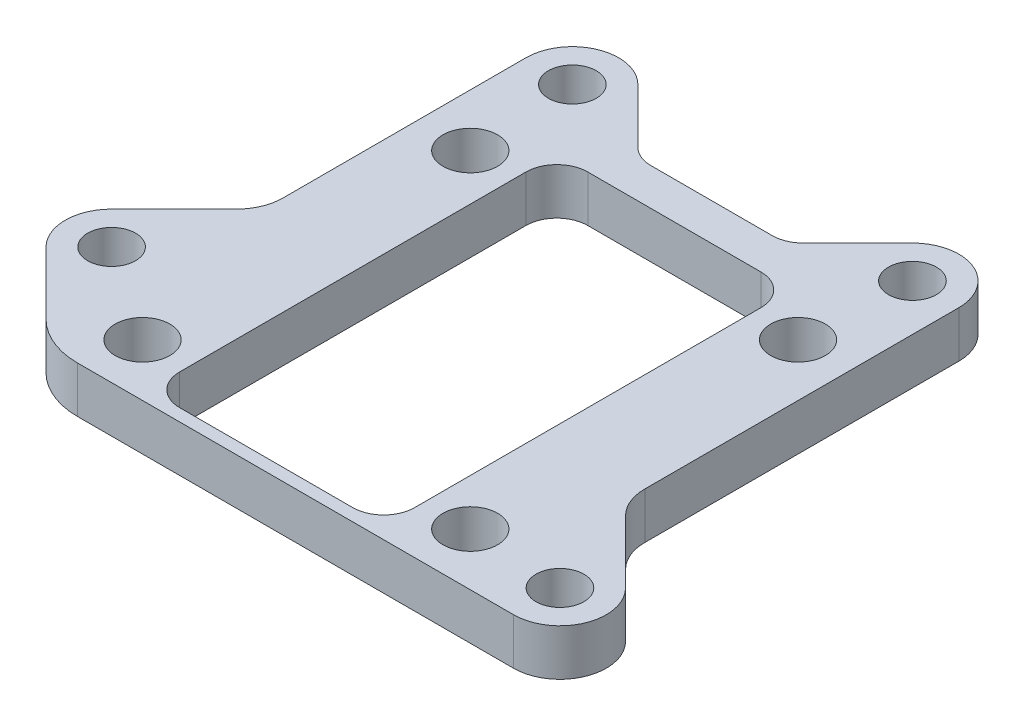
from build123d import *

# Parameters (mm, degrees)
BOSS_EXTRUDE1_DEPTH          = 4.7625
F_2_0_221_DIAMETER_HOLE1_D   = 5.6134
F_10_0_1935_DIAMETER_HOLE1_D = 4.9149


with BuildPart() as part:
    # Sketch1 → Boss-Extrude1 (new body)
    with BuildSketch(Plane(origin=(0, 0, 0), x_dir=(1, 0, 0), z_dir=(0, 1, 0))):
        with BuildLine():
            Line((-6.237179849, 24.765), (6.237179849, 24.765))
            ThreePointArc((6.237179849, 24.765), (7.452199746, 25.006682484), (8.482243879, 25.69493597))
            Line((8.482243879, 25.69493597), (14.094903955, 31.307596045))
            ThreePointArc((14.094903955, 31.307596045), (19.285029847, 32.339976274), (22.225, 27.94))
            Line((22.225, 27.94), (22.225, -4.309615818))
            ThreePointArc((22.225, -4.309615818), (22.587523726, -6.132145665), (23.619903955, -7.677211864))
            Line((23.619903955, -7.677211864), (30.037596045, -14.094903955))
            ThreePointArc((30.037596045, -14.094903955), (31.069976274, -19.285029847), (26.67, -22.225))
            Line((26.67, -22.225), (-18.116192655, -22.225))
            ThreePointArc((-18.116192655, -22.225), (-21.094779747, -21.63252219), (-23.619903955, -19.945288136))
            Line((-23.619903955, -19.945288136), (-30.037596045, -13.527596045))
            ThreePointArc((-30.037596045, -13.527596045), (-31.4325, -10.16), (-30.037596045, -6.792403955))
            Line((-30.037596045, -6.792403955), (-23.619903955, -0.374711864))
            ThreePointArc((-23.619903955, -0.374711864), (-22.587523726, 1.170354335), (-22.225, 2.992884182))
            Line((-22.225, 2.992884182), (-22.225, 27.94))
            ThreePointArc((-22.225, 27.94), (-19.285029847, 32.339976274), (-14.094903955, 31.307596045))
            Line((-14.094903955, 31.307596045), (-8.482243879, 25.69493597))
            ThreePointArc((-8.482243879, 25.69493597), (-7.452199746, 25.006682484), (-6.237179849, 24.765))
        make_face()
        with BuildLine():
            Line((-8.89, -20.955), (8.89, -20.955))
            ThreePointArc((8.89, -20.955), (11.13506403, -20.02506403), (12.065, -17.78))
            Line((12.065, -17.78), (12.065, 17.78))
            ThreePointArc((12.065, 17.78), (11.13506403, 20.02506403), (8.89, 20.955))
            Line((8.89, 20.955), (-8.89, 20.955))
            ThreePointArc((-8.89, 20.955), (-11.13506403, 20.02506403), (-12.065, 17.78))
            Line((-12.065, 17.78), (-12.065, -17.78))
            ThreePointArc((-12.065, -17.78), (-11.13506403, -20.02506403), (-8.89, -20.955))
        make_face(mode=Mode.SUBTRACT)
    extrude(amount=BOSS_EXTRUDE1_DEPTH)

    # 2 _0.221_ Diameter Hole1 (through all)
    with Locations(Plane(origin=(0, 4.7625, 0), x_dir=(1, 0, 0), z_dir=(0, 1, 0))):
        with Locations((0, 0), (-16.8275, 16.8275), (16.8275, -16.8275), (16.8275, 16.8275), (-16.8275, -16.8275)):
            Hole(F_2_0_221_DIAMETER_HOLE1_D / 2)

    # 10 _0.1935_ Diameter Hole1 (through all)
    with Locations(Plane(origin=(0, 4.7625, 0), x_dir=(1, 0, 0), z_dir=(0, 1, 0))):
        with Locations((-17.4625, 27.94), (17.4625, 27.94), (-26.67, -10.16), (26.67, -17.4625)):
            Hole(F_10_0_1935_DIAMETER_HOLE1_D / 2)


solid = part.part
